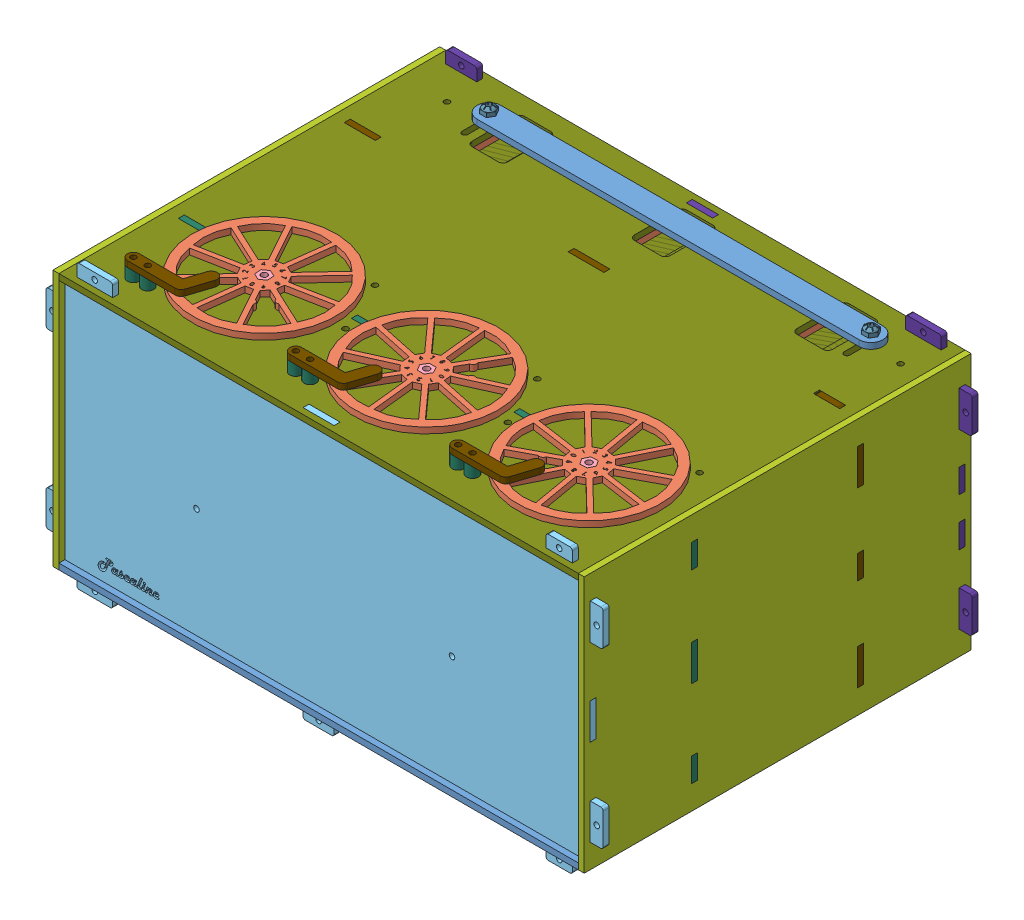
SolidWorks assembly Pascaline.SLDASM, configuration Default (file format 7000). Lengths in mm.
Overall size (316.89 316.89 215.17).
284 component instances, 43 part files, 62 mates.
Components (placement in the parent):
- BottomPanel-1: BottomPanel.SLDPRT [Default] at (-116.7085 3.175 3.175) x (1 0 0) z (0 0 -1) size (276.23 3.17 205.74)
- Input-1: Input.SLDASM [Default] at (-58.9964 162.0917 -49.9048) x (0.085321 0 0.996353) z (-0.996353 0 0.085321) size (104.09 73.64 104.09)
  - InputWheel-1: InputWheel.SLDPRT [Default] at (2.3319 -25.5667 -0.5108) x (0.5 0 -0.866025) z (0.866025 0 0.5) size (76.2 3.17 76.2)
  - AccumulatorGear-1: AccumulatorGear.SLDPRT [input2] at (2.3319 -73.8052 -0.5108) size (69.85 3.17 69.85)
  - Standoff-2in-1s4-1: Standoff-2in-1s4.SLDPRT [Default] at (2.3319 -73.1917 -0.5108) size (7.33 50.8 6.35)
  - Screw-4-40-1in-1: Screw-4-40-1in.SLDPRT [Default] at (-26.2431 -96.0302 8.7738) size (2.84 25.4 2.84)
  - Screw-4-40-1in-2: Screw-4-40-1in.SLDPRT [Default] at (-15.3284 -96.0302 23.7965) size (2.84 25.4 2.84)
  - Screw-4-40-1in-3: Screw-4-40-1in.SLDPRT [Default] at (-26.2431 -96.0302 -9.7954) size (2.84 25.4 2.84)
- Accumulator-1: Accumulator.SLDASM [Default] at (-69.3205 75.7982 -48.0636) x (0.97927 0.20256 0.00082) z (0.202557 -0.979267 0.002734) size (76.79 111.93 76.84)
  - AccumulatorGear-3: AccumulatorGear.SLDPRT [accum] at (5.3215 -39.4588 28.4724) x (0.104553 -0.002805 0.994515) z (-0.994519 0.00053 0.104555) size (69.85 3.17 69.85)
  - AccumulatorGear-4: AccumulatorGear.SLDPRT [accum] at (5.3032 -61.6837 28.4116) x (0.104553 -0.002805 0.994515) z (-0.994519 0.00053 0.104555) size (69.85 3.17 69.85)
  - Screw-4-40-1in-1: Screw-4-40-1in.SLDPRT [Default] at (-24.5385 -14.043 31.6833) x (0.998773 -0.000684 -0.049509) z (-0.049507 0.002771 -0.99877) size (2.84 25.4 2.84)
  - Screw-4-40-1in-2: Screw-4-40-1in.SLDPRT [Default] at (-20.6782 -13.9965 13.5198) x (0.998773 -0.000684 -0.049509) z (-0.049507 0.002771 -0.99877) size (2.84 25.4 2.84)
  - Screw-4-40-1in-3: Screw-4-40-1in.SLDPRT [Default] at (-16.9854 -14.0955 48.6468) x (0.998773 -0.000684 -0.049509) z (-0.049507 0.002771 -0.99877) size (2.84 25.4 2.84)
  - Screw-4-40-1in-4: Screw-4-40-1in.SLDPRT [Default] at (-24.575 -58.4928 31.5617) x (0.998773 -0.000684 -0.049509) z (-0.049507 0.002771 -0.99877) size (2.84 25.4 2.84)
  - Screw-4-40-1in-5: Screw-4-40-1in.SLDPRT [Default] at (-17.0427 -83.9452 48.4558) x (-0.902967 0.001916 -0.429705) z (0.429708 0.002116 -0.902965) size (2.84 25.4 2.84)
  - Screw-4-40-1in-6: Screw-4-40-1in.SLDPRT [Default] at (-20.7147 -58.4463 13.3983) x (0.998773 -0.000684 -0.049509) z (-0.049507 0.002771 -0.99877) size (2.84 25.4 2.84)
  - OutputGear-1: OutputGear.SLDPRT [Default] at (5.2689 -103.5935 28.297) x (0.104553 -0.002805 0.994515) z (-0.994519 0.00053 0.104555) size (50.8 3.17 50.8)
  - Standoff-4in-1s4-2: Standoff-4in-1s4.SLDPRT [Default] at (5.2689 -103.5935 28.297) x (0.104553 -0.002805 0.994515) z (-0.994519 0.00053 0.104555) size (7.33 101.6 6.35)
  - Screw-4-40-0p5in-1: Screw-4-40-0p5in.SLDPRT [Default] at (-14.6072 -113.1079 30.3598) x (1 -0.00082 -0.000001) z (-0.000001 -0.002734 0.999996) size (2.84 12.7 2.84)
  - Screw-4-40-0p5in-2: Screw-4-40-0p5in.SLDPRT [Default] at (-9.585 -113.1428 41.6391) x (1 -0.00082 -0.000001) z (-0.000001 -0.002734 0.999996) size (2.84 12.7 2.84)
  - Screw-4-40-0p5in-3: Screw-4-40-0p5in.SLDPRT [Default] at (-12.0405 -113.077 18.2826) x (1 -0.00082 -0.000001) z (-0.000001 -0.002734 0.999996) size (2.84 12.7 2.84)
  - Standoff-p75in-1s4-1: Standoff-p75in-1s4.SLDPRT [Default] at (24.329 -39.4366 14.6619) x (1 -0.00082 -0.000001) z (-0.00082 -0.999996 -0.002734) size (6.35 6.35 19.05)
  - Standoff-p75in-1s4-2: Standoff-p75in-1s4.SLDPRT [Default] at (-16.1425 -39.415 18.9167) x (0.984615 -0.00033 -0.174737) z (-0.00082 -0.999996 -0.002734) size (6.35 6.35 19.05)
  - OutputGearCap-1: OutputGearCap.SLDPRT [Default] at (5.2663 -106.7685 28.2884) x (0.104553 -0.002805 0.994515) z (-0.994519 0.00053 0.104555) size (21.59 3.17 21.59)
  - Washer-0p38in-1: Washer-0p38in.SLDPRT [Default] at (5.3522 -1.9939 28.5748) x (0.863042 0.000673 -0.505132) z (0.00082 0.999996 0.002734) size (9.65 9.65 0.76)
  - Spacer-stack-8-1: Spacer-stack-8.SLDASM [Default] at (-3.9287 -43.7527 21.5045) x (0.104553 -0.002805 0.994515) z (0.00082 0.999996 0.002734) size (13.2 11.43 25.4)
    - Spacer-hex-1s4-1: Spacer-hex-1s4.SLDPRT [Default] at (7.8847 8.4687 7.4956) size (13.2 11.43 3.17)
    - Spacer-hex-1s4-2: Spacer-hex-1s4.SLDPRT [Default] at (7.8847 8.4687 10.6706) size (13.2 11.43 3.17)
    - Spacer-hex-1s4-3: Spacer-hex-1s4.SLDPRT [Default] at (7.8847 8.4687 13.8456) size (13.2 11.43 3.17)
    - Spacer-hex-1s4-4: Spacer-hex-1s4.SLDPRT [Default] at (7.8847 8.4687 17.0206) size (13.2 11.43 3.17)
    - Spacer-hex-1s4-5: Spacer-hex-1s4.SLDPRT [Default] at (7.8847 8.4687 20.1956) size (13.2 11.43 3.17)
    - Spacer-hex-1s4-6: Spacer-hex-1s4.SLDPRT [Default] at (7.8847 8.4687 23.3706) size (13.2 11.43 3.17)
    - Spacer-hex-1s4-7: Spacer-hex-1s4.SLDPRT [Default] at (7.8847 8.4687 26.5456) size (13.2 11.43 3.17)
    - Spacer-hex-1s4-8: Spacer-hex-1s4.SLDPRT [Default] at (7.8847 8.4687 29.7206) size (13.2 11.43 3.17)
- Readout-1: Readout.SLDASM [Default] at (14.1171 39.2986 -199.7504) x (0.941933 0.3358 0) z (0 0 1) size (85.24 81.6 65.02)
  - Standoff-2p5in-1s4-3: Standoff-2p5in-1s4.SLDPRT [Default] at (-51.5451 71.035 -5.9896) x (0.829038 -0.559193 0) z (-0.559193 -0.829038 0) size (7.33 63.5 6.35)
  - ReadoutGear-1: ReadoutGear.SLDPRT [Default] at (-51.5451 71.035 43.1699) x (0.997564 -0.069756 0) z (0 0 1) size (49.17 51.37 3.17)
  - Spacer-0p25-1s4-4: Spacer-0p25-1s4.SLDPRT [Default] at (-59.1849 67.3088 36.8199) size (6.35 6.35 6.35)
  - Spacer-0p25-1s4-5: Spacer-0p25-1s4.SLDPRT [Default] at (-44.4983 66.2819 36.8199) size (6.35 6.35 6.35)
  - Spacer-0p25-1s4-6: Spacer-0p25-1s4.SLDPRT [Default] at (-50.9522 79.5143 36.8199) size (6.35 6.35 6.35)
  - ReadoutCylinder-1: ReadoutCylinder.SLDPRT [Default] at (-51.5451 71.035 33.6449) x (0.997564 -0.069756 0) z (0 0 1) size (80.12 76.2 3.17)
  - ReadoutCylinder-2: ReadoutCylinder.SLDPRT [Default] at (-51.5451 71.035 30.4699) x (0.997564 -0.069756 0) z (0 0 1) size (80.12 76.2 3.17)
  - ReadoutCylinder-3: ReadoutCylinder.SLDPRT [Default] at (-51.5451 71.035 27.2949) x (0.997564 -0.069756 0) z (0 0 1) size (80.12 76.2 3.17)
  - ReadoutCylinder-4: ReadoutCylinder.SLDPRT [Default] at (-51.5451 71.035 24.1199) x (0.997564 -0.069756 0) z (0 0 1) size (80.12 76.2 3.17)
  - ReadoutCylinder-5: ReadoutCylinder.SLDPRT [Default] at (-51.5451 71.035 20.9449) x (0.997564 -0.069756 0) z (0 0 1) size (80.12 76.2 3.17)
  - ReadoutCylinder-6: ReadoutCylinder.SLDPRT [Default] at (-51.5451 71.035 17.7699) x (0.997564 -0.069756 0) z (0 0 1) size (80.12 76.2 3.17)
  - ReadoutCylinder-7: ReadoutCylinder.SLDPRT [Default] at (-51.5451 71.035 14.5949) x (0.997564 -0.069756 0) z (0 0 1) size (80.12 76.2 3.17)
  - ReadoutCylinder-8: ReadoutCylinder.SLDPRT [Default] at (-51.5451 71.035 11.4199) x (0.997564 -0.069756 0) z (0 0 1) size (80.12 76.2 3.17)
  - Washer-0p38in-1: Washer-0p38in.SLDPRT [Default] at (-51.5451 71.035 57.5104) x (0.999237 0.039047 0) z (0 0 1) size (9.65 9.65 0.76)
  - Washer-0p38in-2: Washer-0p38in.SLDPRT [Default] at (-51.5451 71.035 -6.7516) size (9.65 9.65 0.76)
  - Spacer-hex-1s4-1: Spacer-hex-1s4.SLDPRT [Default] at (-51.5451 71.035 7.2838) x (0.829038 -0.559193 0) z (0 0 1) size (13.2 11.43 3.17)
  - Spacer-hex-1s4-2: Spacer-hex-1s4.SLDPRT [Default] at (-51.5451 71.035 4.1088) x (0.829038 -0.559193 0) z (0 0 1) size (13.2 11.43 3.17)
- Input-2: Input.SLDASM [Default] at (25.7396 162.0917 -47.1142) size (104.09 73.64 104.09)
  - InputWheel-1: InputWheel.SLDPRT [Default] at (2.3319 -25.5667 -0.5108) x (0.5 0 -0.866025) z (0.866025 0 0.5) size (76.2 3.17 76.2)
  - AccumulatorGear-1: AccumulatorGear.SLDPRT [input2] at (2.3319 -73.8052 -0.5108) size (69.85 3.17 69.85)
  - Standoff-2in-1s4-1: Standoff-2in-1s4.SLDPRT [Default] at (2.3319 -73.1917 -0.5108) size (7.33 50.8 6.35)
  - Screw-4-40-1in-1: Screw-4-40-1in.SLDPRT [Default] at (-26.2431 -96.0302 8.7738) size (2.84 25.4 2.84)
  - Screw-4-40-1in-2: Screw-4-40-1in.SLDPRT [Default] at (-15.3284 -96.0302 23.7965) size (2.84 25.4 2.84)
  - Screw-4-40-1in-3: Screw-4-40-1in.SLDPRT [Default] at (-26.2431 -96.0302 -9.7954) size (2.84 25.4 2.84)
- Accumulator-2: Accumulator.SLDASM [Default] at (5.6782 67.443 -48.0636) x (0.768779 0.639514 0.00082) z (0.63951 -0.768778 0.002734) size (76.79 111.93 76.84)
  - AccumulatorGear-3: AccumulatorGear.SLDPRT [accum] at (5.3215 -39.4588 28.4724) x (0.104553 -0.002805 0.994515) z (-0.994519 0.00053 0.104555) size (69.85 3.17 69.85)
  - AccumulatorGear-4: AccumulatorGear.SLDPRT [accum] at (5.3032 -61.6837 28.4116) x (0.104553 -0.002805 0.994515) z (-0.994519 0.00053 0.104555) size (69.85 3.17 69.85)
  - Screw-4-40-1in-1: Screw-4-40-1in.SLDPRT [Default] at (-24.5385 -14.043 31.6833) x (0.998773 -0.000684 -0.049509) z (-0.049507 0.002771 -0.99877) size (2.84 25.4 2.84)
  - Screw-4-40-1in-2: Screw-4-40-1in.SLDPRT [Default] at (-20.6782 -13.9965 13.5198) x (0.998773 -0.000684 -0.049509) z (-0.049507 0.002771 -0.99877) size (2.84 25.4 2.84)
  - Screw-4-40-1in-3: Screw-4-40-1in.SLDPRT [Default] at (-16.9854 -14.0955 48.6468) x (0.998773 -0.000684 -0.049509) z (-0.049507 0.002771 -0.99877) size (2.84 25.4 2.84)
  - Screw-4-40-1in-4: Screw-4-40-1in.SLDPRT [Default] at (-24.575 -58.4928 31.5617) x (0.998773 -0.000684 -0.049509) z (-0.049507 0.002771 -0.99877) size (2.84 25.4 2.84)
  - Screw-4-40-1in-5: Screw-4-40-1in.SLDPRT [Default] at (-17.0427 -83.9452 48.4558) x (-0.902967 0.001916 -0.429705) z (0.429708 0.002116 -0.902965) size (2.84 25.4 2.84)
  - Screw-4-40-1in-6: Screw-4-40-1in.SLDPRT [Default] at (-20.7147 -58.4463 13.3983) x (0.998773 -0.000684 -0.049509) z (-0.049507 0.002771 -0.99877) size (2.84 25.4 2.84)
  - OutputGear-1: OutputGear.SLDPRT [Default] at (5.2689 -103.5935 28.297) x (0.104553 -0.002805 0.994515) z (-0.994519 0.00053 0.104555) size (50.8 3.17 50.8)
  - Standoff-4in-1s4-2: Standoff-4in-1s4.SLDPRT [Default] at (5.2689 -103.5935 28.297) x (0.104553 -0.002805 0.994515) z (-0.994519 0.00053 0.104555) size (7.33 101.6 6.35)
  - Screw-4-40-0p5in-1: Screw-4-40-0p5in.SLDPRT [Default] at (-14.6072 -113.1079 30.3598) x (1 -0.00082 -0.000001) z (-0.000001 -0.002734 0.999996) size (2.84 12.7 2.84)
  - Screw-4-40-0p5in-2: Screw-4-40-0p5in.SLDPRT [Default] at (-9.585 -113.1428 41.6391) x (1 -0.00082 -0.000001) z (-0.000001 -0.002734 0.999996) size (2.84 12.7 2.84)
  - Screw-4-40-0p5in-3: Screw-4-40-0p5in.SLDPRT [Default] at (-12.0405 -113.077 18.2826) x (1 -0.00082 -0.000001) z (-0.000001 -0.002734 0.999996) size (2.84 12.7 2.84)
  - Standoff-p75in-1s4-1: Standoff-p75in-1s4.SLDPRT [Default] at (24.329 -39.4366 14.6619) x (1 -0.00082 -0.000001) z (-0.00082 -0.999996 -0.002734) size (6.35 6.35 19.05)
  - Standoff-p75in-1s4-2: Standoff-p75in-1s4.SLDPRT [Default] at (-16.1425 -39.415 18.9167) x (0.984615 -0.00033 -0.174737) z (-0.00082 -0.999996 -0.002734) size (6.35 6.35 19.05)
  - OutputGearCap-1: OutputGearCap.SLDPRT [Default] at (5.2663 -106.7685 28.2884) x (0.104553 -0.002805 0.994515) z (-0.994519 0.00053 0.104555) size (21.59 3.17 21.59)
  - Washer-0p38in-1: Washer-0p38in.SLDPRT [Default] at (5.3522 -1.9939 28.5748) x (0.863042 0.000673 -0.505132) z (0.00082 0.999996 0.002734) size (9.65 9.65 0.76)
  - Spacer-stack-8-1: Spacer-stack-8.SLDASM [Default] at (-3.9287 -43.7527 21.5045) x (0.104553 -0.002805 0.994515) z (0.00082 0.999996 0.002734) size (13.2 11.43 25.4)
    - Spacer-hex-1s4-1: Spacer-hex-1s4.SLDPRT [Default] at (7.8847 8.4687 7.4956) size (13.2 11.43 3.17)
    - Spacer-hex-1s4-2: Spacer-hex-1s4.SLDPRT [Default] at (7.8847 8.4687 10.6706) size (13.2 11.43 3.17)
    - Spacer-hex-1s4-3: Spacer-hex-1s4.SLDPRT [Default] at (7.8847 8.4687 13.8456) size (13.2 11.43 3.17)
    - Spacer-hex-1s4-4: Spacer-hex-1s4.SLDPRT [Default] at (7.8847 8.4687 17.0206) size (13.2 11.43 3.17)
    - Spacer-hex-1s4-5: Spacer-hex-1s4.SLDPRT [Default] at (7.8847 8.4687 20.1956) size (13.2 11.43 3.17)
    - Spacer-hex-1s4-6: Spacer-hex-1s4.SLDPRT [Default] at (7.8847 8.4687 23.3706) size (13.2 11.43 3.17)
    - Spacer-hex-1s4-7: Spacer-hex-1s4.SLDPRT [Default] at (7.8847 8.4687 26.5456) size (13.2 11.43 3.17)
    - Spacer-hex-1s4-8: Spacer-hex-1s4.SLDPRT [Default] at (7.8847 8.4687 29.7206) size (13.2 11.43 3.17)
- Readout-2: Readout.SLDASM [Default] at (59.1789 6.8317 -199.7504) x (0.964985 -0.262305 0) z (0 0 1) size (85.24 81.6 65.02)
  - Standoff-2p5in-1s4-3: Standoff-2p5in-1s4.SLDPRT [Default] at (-51.5451 71.035 -5.9896) x (0.829038 -0.559193 0) z (-0.559193 -0.829038 0) size (7.33 63.5 6.35)
  - ReadoutGear-1: ReadoutGear.SLDPRT [Default] at (-51.5451 71.035 43.1699) x (0.997564 -0.069756 0) z (0 0 1) size (49.17 51.37 3.17)
  - Spacer-0p25-1s4-4: Spacer-0p25-1s4.SLDPRT [Default] at (-59.1849 67.3088 36.8199) size (6.35 6.35 6.35)
  - Spacer-0p25-1s4-5: Spacer-0p25-1s4.SLDPRT [Default] at (-44.4983 66.2819 36.8199) size (6.35 6.35 6.35)
  - Spacer-0p25-1s4-6: Spacer-0p25-1s4.SLDPRT [Default] at (-50.9522 79.5143 36.8199) size (6.35 6.35 6.35)
  - ReadoutCylinder-1: ReadoutCylinder.SLDPRT [Default] at (-51.5451 71.035 33.6449) x (0.997564 -0.069756 0) z (0 0 1) size (80.12 76.2 3.17)
  - ReadoutCylinder-2: ReadoutCylinder.SLDPRT [Default] at (-51.5451 71.035 30.4699) x (0.997564 -0.069756 0) z (0 0 1) size (80.12 76.2 3.17)
  - ReadoutCylinder-3: ReadoutCylinder.SLDPRT [Default] at (-51.5451 71.035 27.2949) x (0.997564 -0.069756 0) z (0 0 1) size (80.12 76.2 3.17)
  - ReadoutCylinder-4: ReadoutCylinder.SLDPRT [Default] at (-51.5451 71.035 24.1199) x (0.997564 -0.069756 0) z (0 0 1) size (80.12 76.2 3.17)
  - ReadoutCylinder-5: ReadoutCylinder.SLDPRT [Default] at (-51.5451 71.035 20.9449) x (0.997564 -0.069756 0) z (0 0 1) size (80.12 76.2 3.17)
  - ReadoutCylinder-6: ReadoutCylinder.SLDPRT [Default] at (-51.5451 71.035 17.7699) x (0.997564 -0.069756 0) z (0 0 1) size (80.12 76.2 3.17)
  - ReadoutCylinder-7: ReadoutCylinder.SLDPRT [Default] at (-51.5451 71.035 14.5949) x (0.997564 -0.069756 0) z (0 0 1) size (80.12 76.2 3.17)
  - ReadoutCylinder-8: ReadoutCylinder.SLDPRT [Default] at (-51.5451 71.035 11.4199) x (0.997564 -0.069756 0) z (0 0 1) size (80.12 76.2 3.17)
  - Washer-0p38in-1: Washer-0p38in.SLDPRT [Default] at (-51.5451 71.035 57.5104) x (0.999237 0.039047 0) z (0 0 1) size (9.65 9.65 0.76)
  - Washer-0p38in-2: Washer-0p38in.SLDPRT [Default] at (-51.5451 71.035 -6.7516) size (9.65 9.65 0.76)
  - Spacer-hex-1s4-1: Spacer-hex-1s4.SLDPRT [Default] at (-51.5451 71.035 7.2838) x (0.829038 -0.559193 0) z (0 0 1) size (13.2 11.43 3.17)
  - Spacer-hex-1s4-2: Spacer-hex-1s4.SLDPRT [Default] at (-51.5451 71.035 4.1088) x (0.829038 -0.559193 0) z (0 0 1) size (13.2 11.43 3.17)
- Input-3: Input.SLDASM [Default] at (116.724 162.0917 -48.2907) x (-0.997759 0 0.066903) z (-0.066903 0 -0.997759) size (104.09 73.64 104.09)
  - InputWheel-1: InputWheel.SLDPRT [Default] at (2.3319 -25.5667 -0.5108) x (0.5 0 -0.866025) z (0.866025 0 0.5) size (76.2 3.17 76.2)
  - AccumulatorGear-1: AccumulatorGear.SLDPRT [input2] at (2.3319 -73.8052 -0.5108) size (69.85 3.17 69.85)
  - Standoff-2in-1s4-1: Standoff-2in-1s4.SLDPRT [Default] at (2.3319 -73.1917 -0.5108) size (7.33 50.8 6.35)
  - Screw-4-40-1in-1: Screw-4-40-1in.SLDPRT [Default] at (-26.2431 -96.0302 8.7738) size (2.84 25.4 2.84)
  - Screw-4-40-1in-2: Screw-4-40-1in.SLDPRT [Default] at (-15.3284 -96.0302 23.7965) size (2.84 25.4 2.84)
  - Screw-4-40-1in-3: Screw-4-40-1in.SLDPRT [Default] at (-26.2431 -96.0302 -9.7954) size (2.84 25.4 2.84)
- Accumulator-4: Accumulator.SLDASM [Default] at (141.6672 59.0787 -48.0636) x (0.171779 -0.985135 0.00082) z (-0.985132 -0.171776 0.002734) size (76.79 111.93 76.84)
  - AccumulatorGear-3: AccumulatorGear.SLDPRT [accum] at (5.3215 -39.4588 28.4724) x (0.104553 -0.002805 0.994515) z (-0.994519 0.00053 0.104555) size (69.85 3.17 69.85)
  - AccumulatorGear-4: AccumulatorGear.SLDPRT [accum] at (5.3032 -61.6837 28.4116) x (0.104553 -0.002805 0.994515) z (-0.994519 0.00053 0.104555) size (69.85 3.17 69.85)
  - Screw-4-40-1in-1: Screw-4-40-1in.SLDPRT [Default] at (-24.5385 -14.043 31.6833) x (0.998773 -0.000684 -0.049509) z (-0.049507 0.002771 -0.99877) size (2.84 25.4 2.84)
  - Screw-4-40-1in-2: Screw-4-40-1in.SLDPRT [Default] at (-20.6782 -13.9965 13.5198) x (0.998773 -0.000684 -0.049509) z (-0.049507 0.002771 -0.99877) size (2.84 25.4 2.84)
  - Screw-4-40-1in-3: Screw-4-40-1in.SLDPRT [Default] at (-16.9854 -14.0955 48.6468) x (0.998773 -0.000684 -0.049509) z (-0.049507 0.002771 -0.99877) size (2.84 25.4 2.84)
  - Screw-4-40-1in-4: Screw-4-40-1in.SLDPRT [Default] at (-24.575 -58.4928 31.5617) x (0.998773 -0.000684 -0.049509) z (-0.049507 0.002771 -0.99877) size (2.84 25.4 2.84)
  - Screw-4-40-1in-5: Screw-4-40-1in.SLDPRT [Default] at (-17.0427 -83.9452 48.4558) x (-0.902967 0.001916 -0.429705) z (0.429708 0.002116 -0.902965) size (2.84 25.4 2.84)
  - Screw-4-40-1in-6: Screw-4-40-1in.SLDPRT [Default] at (-20.7147 -58.4463 13.3983) x (0.998773 -0.000684 -0.049509) z (-0.049507 0.002771 -0.99877) size (2.84 25.4 2.84)
  - OutputGear-1: OutputGear.SLDPRT [Default] at (5.2689 -103.5935 28.297) x (0.104553 -0.002805 0.994515) z (-0.994519 0.00053 0.104555) size (50.8 3.17 50.8)
  - Standoff-4in-1s4-2: Standoff-4in-1s4.SLDPRT [Default] at (5.2689 -103.5935 28.297) x (0.104553 -0.002805 0.994515) z (-0.994519 0.00053 0.104555) size (7.33 101.6 6.35)
  - Screw-4-40-0p5in-1: Screw-4-40-0p5in.SLDPRT [Default] at (-14.6072 -113.1079 30.3598) x (1 -0.00082 -0.000001) z (-0.000001 -0.002734 0.999996) size (2.84 12.7 2.84)
  - Screw-4-40-0p5in-2: Screw-4-40-0p5in.SLDPRT [Default] at (-9.585 -113.1428 41.6391) x (1 -0.00082 -0.000001) z (-0.000001 -0.002734 0.999996) size (2.84 12.7 2.84)
  - Screw-4-40-0p5in-3: Screw-4-40-0p5in.SLDPRT [Default] at (-12.0405 -113.077 18.2826) x (1 -0.00082 -0.000001) z (-0.000001 -0.002734 0.999996) size (2.84 12.7 2.84)
  - Standoff-p75in-1s4-1: Standoff-p75in-1s4.SLDPRT [Default] at (24.329 -39.4366 14.6619) x (1 -0.00082 -0.000001) z (-0.00082 -0.999996 -0.002734) size (6.35 6.35 19.05)
  - Standoff-p75in-1s4-2: Standoff-p75in-1s4.SLDPRT [Default] at (-16.1425 -39.415 18.9167) x (0.984615 -0.00033 -0.174737) z (-0.00082 -0.999996 -0.002734) size (6.35 6.35 19.05)
  - OutputGearCap-1: OutputGearCap.SLDPRT [Default] at (5.2663 -106.7685 28.2884) x (0.104553 -0.002805 0.994515) z (-0.994519 0.00053 0.104555) size (21.59 3.17 21.59)
  - Washer-0p38in-1: Washer-0p38in.SLDPRT [Default] at (5.3522 -1.9939 28.5748) x (0.863042 0.000673 -0.505132) z (0.00082 0.999996 0.002734) size (9.65 9.65 0.76)
  - Spacer-stack-8-1: Spacer-stack-8.SLDASM [Default] at (-3.9287 -43.7527 21.5045) x (0.104553 -0.002805 0.994515) z (0.00082 0.999996 0.002734) size (13.2 11.43 25.4)
    - Spacer-hex-1s4-1: Spacer-hex-1s4.SLDPRT [Default] at (7.8847 8.4687 7.4956) size (13.2 11.43 3.17)
    - Spacer-hex-1s4-2: Spacer-hex-1s4.SLDPRT [Default] at (7.8847 8.4687 10.6706) size (13.2 11.43 3.17)
    - Spacer-hex-1s4-3: Spacer-hex-1s4.SLDPRT [Default] at (7.8847 8.4687 13.8456) size (13.2 11.43 3.17)
    - Spacer-hex-1s4-4: Spacer-hex-1s4.SLDPRT [Default] at (7.8847 8.4687 17.0206) size (13.2 11.43 3.17)
    - Spacer-hex-1s4-5: Spacer-hex-1s4.SLDPRT [Default] at (7.8847 8.4687 20.1956) size (13.2 11.43 3.17)
    - Spacer-hex-1s4-6: Spacer-hex-1s4.SLDPRT [Default] at (7.8847 8.4687 23.3706) size (13.2 11.43 3.17)
    - Spacer-hex-1s4-7: Spacer-hex-1s4.SLDPRT [Default] at (7.8847 8.4687 26.5456) size (13.2 11.43 3.17)
    - Spacer-hex-1s4-8: Spacer-hex-1s4.SLDPRT [Default] at (7.8847 8.4687 29.7206) size (13.2 11.43 3.17)
- Readout-3: Readout.SLDASM [Default] at (148.6851 8.0943 -199.7504) x (0.974395 -0.224842 0) z (0 0 1) size (85.24 81.6 65.02)
  - Standoff-2p5in-1s4-3: Standoff-2p5in-1s4.SLDPRT [Default] at (-51.5451 71.035 -5.9896) x (0.829038 -0.559193 0) z (-0.559193 -0.829038 0) size (7.33 63.5 6.35)
  - ReadoutGear-1: ReadoutGear.SLDPRT [Default] at (-51.5451 71.035 43.1699) x (0.997564 -0.069756 0) z (0 0 1) size (49.17 51.37 3.17)
  - Spacer-0p25-1s4-4: Spacer-0p25-1s4.SLDPRT [Default] at (-59.1849 67.3088 36.8199) size (6.35 6.35 6.35)
  - Spacer-0p25-1s4-5: Spacer-0p25-1s4.SLDPRT [Default] at (-44.4983 66.2819 36.8199) size (6.35 6.35 6.35)
  - Spacer-0p25-1s4-6: Spacer-0p25-1s4.SLDPRT [Default] at (-50.9522 79.5143 36.8199) size (6.35 6.35 6.35)
  - ReadoutCylinder-1: ReadoutCylinder.SLDPRT [Default] at (-51.5451 71.035 33.6449) x (0.997564 -0.069756 0) z (0 0 1) size (80.12 76.2 3.17)
  - ReadoutCylinder-2: ReadoutCylinder.SLDPRT [Default] at (-51.5451 71.035 30.4699) x (0.997564 -0.069756 0) z (0 0 1) size (80.12 76.2 3.17)
  - ReadoutCylinder-3: ReadoutCylinder.SLDPRT [Default] at (-51.5451 71.035 27.2949) x (0.997564 -0.069756 0) z (0 0 1) size (80.12 76.2 3.17)
  - ReadoutCylinder-4: ReadoutCylinder.SLDPRT [Default] at (-51.5451 71.035 24.1199) x (0.997564 -0.069756 0) z (0 0 1) size (80.12 76.2 3.17)
  - ReadoutCylinder-5: ReadoutCylinder.SLDPRT [Default] at (-51.5451 71.035 20.9449) x (0.997564 -0.069756 0) z (0 0 1) size (80.12 76.2 3.17)
  - ReadoutCylinder-6: ReadoutCylinder.SLDPRT [Default] at (-51.5451 71.035 17.7699) x (0.997564 -0.069756 0) z (0 0 1) size (80.12 76.2 3.17)
  - ReadoutCylinder-7: ReadoutCylinder.SLDPRT [Default] at (-51.5451 71.035 14.5949) x (0.997564 -0.069756 0) z (0 0 1) size (80.12 76.2 3.17)
  - ReadoutCylinder-8: ReadoutCylinder.SLDPRT [Default] at (-51.5451 71.035 11.4199) x (0.997564 -0.069756 0) z (0 0 1) size (80.12 76.2 3.17)
  - Washer-0p38in-1: Washer-0p38in.SLDPRT [Default] at (-51.5451 71.035 57.5104) x (0.999237 0.039047 0) z (0 0 1) size (9.65 9.65 0.76)
  - Washer-0p38in-2: Washer-0p38in.SLDPRT [Default] at (-51.5451 71.035 -6.7516) size (9.65 9.65 0.76)
  - Spacer-hex-1s4-1: Spacer-hex-1s4.SLDPRT [Default] at (-51.5451 71.035 7.2838) x (0.829038 -0.559193 0) z (0 0 1) size (13.2 11.43 3.17)
  - Spacer-hex-1s4-2: Spacer-hex-1s4.SLDPRT [Default] at (-51.5451 71.035 4.1088) x (0.829038 -0.559193 0) z (0 0 1) size (13.2 11.43 3.17)
- BackPanel-1: BackPanel.SLDPRT [Default] at (-116.7085 3.175 -199.39) size (296.29 150.24 3.18)
- Ratchets-1: Ratchets.SLDASM [Default] at (-81.708 -156.4494 -388.6538) x (0.938568 0.345094 0) z (0 0 1) size (314.7 232.09 30.1)
  - MidPanel2-1: MidPanel2.SLDPRT [Default] at (22.2351 161.8968 243.2388) x (0.938568 -0.345094 0) z (0 0 1) size (282.58 143.38 3.18)
  - Standoff-0p75in-1s4-2: Standoff-0p75in-1s4.SLDPRT [Default] at (71.4078 258.8325 265.4638) x (-0.999902 -0.013974 0) z (0.013974 -0.999902 0) size (7.33 19.05 6.35)
  - Washer-0p38in-4: Washer-0p38in.SLDPRT [Default] at (71.4078 258.8325 265.4638) x (0.886945 0.461875 0) z (0 0 1) size (9.65 9.65 0.76)
  - Spacer-0p25-1s4-1: Spacer-0p25-1s4.SLDPRT [Default] at (71.4078 258.8325 266.2258) x (0.918268 0.39596 0) z (0 0 1) size (6.35 6.35 6.35)
  - Washer-0p38in-1: Washer-0p38in.SLDPRT [Default] at (71.4078 258.8325 272.5758) x (0.974797 -0.223092 0) z (0 0 1) size (9.65 9.65 0.76)
  - Standoff-0p75in-1s4-1: Standoff-0p75in-1s4.SLDPRT [Default] at (152.4626 229.0302 265.4638) x (-0.830154 -0.557534 0) z (0.557534 -0.830154 0) size (7.33 19.05 6.35)
  - Washer-0p38in-5: Washer-0p38in.SLDPRT [Default] at (152.4626 229.0302 265.4638) x (0.971362 -0.237603 0) z (0 0 1) size (9.65 9.65 0.76)
  - Spacer-0p25-1s4-2: Spacer-0p25-1s4.SLDPRT [Default] at (152.4626 229.0302 266.2258) x (0.998153 0.060744 0) z (0 0 1) size (6.35 6.35 6.35)
  - Washer-0p38in-2: Washer-0p38in.SLDPRT [Default] at (152.4626 229.0302 272.5758) x (0.964442 -0.264293 0) z (0 0 1) size (9.65 9.65 0.76)
  - Standoff-0p75in-1s4-3: Standoff-0p75in-1s4.SLDPRT [Default] at (233.5173 199.2278 265.4638) x (0.732123 -0.681172 0) z (0.681172 0.732123 0) size (7.33 19.05 6.35)
  - Washer-0p38in-6: Washer-0p38in.SLDPRT [Default] at (233.5173 199.2278 265.4638) x (0.998962 0.045555 0) z (0 0 1) size (9.65 9.65 0.76)
  - Spacer-0p25-1s4-3: Spacer-0p25-1s4.SLDPRT [Default] at (233.5173 199.2278 266.2258) x (-0.1226 0.992456 0) z (0 0 1) size (6.35 6.35 6.35)
  - Washer-0p38in-3: Washer-0p38in.SLDPRT [Default] at (233.5173 199.2278 272.5758) x (0.76285 -0.646575 0) z (0 0 1) size (9.65 9.65 0.76)
  - SautoirBacking-2: SautoirBacking.SLDPRT [Default] at (77.1723 171.4661 252.7638) x (0.938568 -0.345094 0) z (0 0 1) size (30.48 35.56 3.17)
  - Spacer-0p25-1s4-4: Spacer-0p25-1s4.SLDPRT [Default] at (97.8841 198.3555 246.4138) size (6.35 6.35 6.35)
  - Spacer-0p25-1s4-5: Spacer-0p25-1s4.SLDPRT [Default] at (87.8039 170.9399 246.4138) size (6.35 6.35 6.35)
  - SautoirBacking-3: SautoirBacking.SLDPRT [Default] at (158.2271 141.6638 252.7638) x (0.938568 -0.345094 0) z (0 0 1) size (30.48 35.56 3.17)
  - Spacer-0p25-1s4-6: Spacer-0p25-1s4.SLDPRT [Default] at (168.8586 141.1376 246.4138) size (6.35 6.35 6.35)
  - Spacer-0p25-1s4-7: Spacer-0p25-1s4.SLDPRT [Default] at (178.9388 168.5531 246.4138) x (-0.849972 -0.526827 0) z (0 0 1) size (6.35 6.35 6.35)
- Backstop-1: Backstop.SLDASM [Default] at (-134.4479 68.9887 -194.8362) x (0.911442 -0.411429 0) z (0 0 1) size (69.7 32.28 14.68)
  - BackstopPawl-1: BackstopPawl.SLDPRT [Default] at (4.0576 45.8485 75.5832) size (69.7 32.28 3.18)
  - BackstopPawl-2: BackstopPawl.SLDPRT [Default] at (4.0576 45.8485 72.4082) size (69.7 32.28 3.18)
  - Nut-3s8-1: Nut-3s8.SLDPRT [Default] at (57.7688 59.5119 70.4238) x (0 0 1) z (0 -1 0) size (8.33 14.29 16.5)
  - BackstopCap-1: BackstopCap.SLDPRT [Default] at (57.7688 59.5119 67.2488) x (0.989802 0.142448 0) z (0 0 1) size (15.88 15.88 3.17)
  - BackstopCap-2: BackstopCap.SLDPRT [Default] at (57.7688 59.5119 78.7582) x (0.999963 -0.008552 0) z (0 0 1) size (15.88 15.88 3.17)
- Backstop-2: Backstop.SLDASM [Default] at (-49.066 69.7128 -194.8362) x (0.901561 -0.432653 0) z (0 0 1) size (69.7 32.28 14.68)
  - BackstopPawl-1: BackstopPawl.SLDPRT [Default] at (4.0576 45.8485 75.5832) size (69.7 32.28 3.18)
  - BackstopPawl-2: BackstopPawl.SLDPRT [Default] at (4.0576 45.8485 72.4082) size (69.7 32.28 3.18)
  - Nut-3s8-1: Nut-3s8.SLDPRT [Default] at (57.7688 59.5119 70.4238) x (0 0 1) z (0 -1 0) size (8.33 14.29 16.5)
  - BackstopCap-1: BackstopCap.SLDPRT [Default] at (57.7688 59.5119 67.2488) x (0.989802 0.142448 0) z (0 0 1) size (15.88 15.88 3.17)
  - BackstopCap-2: BackstopCap.SLDPRT [Default] at (57.7688 59.5119 78.7582) x (0.999963 -0.008552 0) z (0 0 1) size (15.88 15.88 3.17)
- Backstop-3: Backstop.SLDASM [Default] at (38.2293 69.0196 -194.8362) x (0.911023 -0.412356 0) z (0 0 1) size (69.7 32.28 14.68)
  - BackstopPawl-1: BackstopPawl.SLDPRT [Default] at (4.0576 45.8485 75.5832) size (69.7 32.28 3.18)
  - BackstopPawl-2: BackstopPawl.SLDPRT [Default] at (4.0576 45.8485 72.4082) size (69.7 32.28 3.18)
  - Nut-3s8-1: Nut-3s8.SLDPRT [Default] at (57.7688 59.5119 70.4238) x (0 0 1) z (0 -1 0) size (8.33 14.29 16.5)
  - BackstopCap-1: BackstopCap.SLDPRT [Default] at (57.7688 59.5119 67.2488) x (0.989802 0.142448 0) z (0 0 1) size (15.88 15.88 3.17)
  - BackstopCap-2: BackstopCap.SLDPRT [Default] at (57.7688 59.5119 78.7582) x (0.999963 -0.008552 0) z (0 0 1) size (15.88 15.88 3.17)
- Sautoir-1: Sautoir.SLDASM [Default] at (-1.8737 11.0276 -154.4839) x (0 0 1) z (-0.978763 0.204997 0) size (57.15 100.16 88.9)
  - SautoirMount-1: SautoirMount.SLDPRT [SautoirMountA] at (12.2439 19.1483 75.6794) size (3.17 12.7 68.58)
  - SautoirMount-2: SautoirMount.SLDPRT [SautoirMountB] at (15.4189 19.1483 75.6794) size (3.17 12.7 68.58)
  - SautoirMountC2-3: SautoirMountC2.SLDPRT [Default] at (18.5939 19.1483 29.3244) x (0 0 1) z (-1 0 0) size (19.05 12.7 3.17)
  - SautoirMountC2-2: SautoirMountC2.SLDPRT [Default] at (21.7689 19.1483 29.3244) x (0 0 1) z (-1 0 0) size (19.05 12.7 3.17)
  - Standoff-1p75in-1s4-1: Standoff-1p75in-1s4.SLDPRT [Default] at (59.8689 25.4983 19.7994) x (0 0.866025 0.5) z (0 -0.5 0.866025) size (7.33 44.45 6.35)
  - SautoirArm-1: SautoirArm.SLDPRT [Default] at (24.9439 6.4483 26.1494) x (0 0 -1) z (1 0 0) size (12.7 38.1 3.17)
  - SautoirArm-2: SautoirArm.SLDPRT [Default] at (34.4689 6.4483 26.1494) x (0 0 -1) z (1 0 0) size (12.7 38.1 3.17)
  - CarryPawl-4: CarryPawl.SLDPRT [Default] at (28.1189 -18.4346 33.7088) x (0 0.213886 -0.976859) z (1 0 0) size (55.75 22.21 3.05)
  - CarryPawl-3: CarryPawl.SLDPRT [Default] at (31.1669 -18.4346 33.7088) x (0 0.213886 -0.976859) z (1 0 0) size (55.75 22.21 3.05)
  - CarryLever-2: CarryLever.SLDPRT [CarryLeverB] at (56.6939 19.7833 26.1494) x (0 0 -1) z (1 0 0) size (39.37 87.39 3.17)
  - CarryLever-3: CarryLever.SLDPRT [CarryLeverA] at (59.8689 19.7833 26.1494) x (0 0 -1) z (1 0 0) size (39.37 87.39 3.17)
  - SautoirMountC-3: SautoirMountC.SLDPRT [Default] at (53.5189 31.8483 9.4956) x (0 0 -1) z (-1 0 0) size (17.14 12.7 3.17)
  - Spacer-0p25-1s4-1: Spacer-0p25-1s4.SLDPRT [Default] at (28.1189 38.1983 19.7994) x (0 0 -1) z (1 0 0) size (6.35 6.35 6.35)
  - Bolt-3s8-0p625-1: Bolt-3s8-0p625.SLDPRT [Default] at (63.0439 70.5305 5.3227) x (1 0 0) z (0 -0.672316 0.740264) size (22.23 14.29 16.5)
  - Nut-3s8-1: Nut-3s8.SLDPRT [Default] at (48.3595 70.5305 5.3227) x (1 0 0) z (0 -0.672316 0.740264) size (8.33 14.29 16.5)
  - Locknut-1: Locknut.SLDPRT [Default] at (39.7648 12.7983 19.7994) x (0 0 1) z (-1 0 0) size (7.33 6.35 3.56)
- Sautoir-2: Sautoir.SLDASM [Default] at (85.88 13.1914 -154.4839) x (0 0 1) z (-0.985824 0.167782 0) size (57.15 100.16 88.9)
  - SautoirMount-1: SautoirMount.SLDPRT [SautoirMountA] at (12.2439 19.1483 75.6794) size (3.17 12.7 68.58)
  - SautoirMount-2: SautoirMount.SLDPRT [SautoirMountB] at (15.4189 19.1483 75.6794) size (3.17 12.7 68.58)
  - SautoirMountC2-3: SautoirMountC2.SLDPRT [Default] at (18.5939 19.1483 29.3244) x (0 0 1) z (-1 0 0) size (19.05 12.7 3.17)
  - SautoirMountC2-2: SautoirMountC2.SLDPRT [Default] at (21.7689 19.1483 29.3244) x (0 0 1) z (-1 0 0) size (19.05 12.7 3.17)
  - Standoff-1p75in-1s4-1: Standoff-1p75in-1s4.SLDPRT [Default] at (59.8689 25.4983 19.7994) x (0 0.866025 0.5) z (0 -0.5 0.866025) size (7.33 44.45 6.35)
  - SautoirArm-1: SautoirArm.SLDPRT [Default] at (24.9439 6.4483 26.1494) x (0 0 -1) z (1 0 0) size (12.7 38.1 3.17)
  - SautoirArm-2: SautoirArm.SLDPRT [Default] at (34.4689 6.4483 26.1494) x (0 0 -1) z (1 0 0) size (12.7 38.1 3.17)
  - CarryPawl-4: CarryPawl.SLDPRT [Default] at (28.1189 -18.4346 33.7088) x (0 0.213886 -0.976859) z (1 0 0) size (55.75 22.21 3.05)
  - CarryPawl-3: CarryPawl.SLDPRT [Default] at (31.1669 -18.4346 33.7088) x (0 0.213886 -0.976859) z (1 0 0) size (55.75 22.21 3.05)
  - CarryLever-2: CarryLever.SLDPRT [CarryLeverB] at (56.6939 19.7833 26.1494) x (0 0 -1) z (1 0 0) size (39.37 87.39 3.17)
  - CarryLever-3: CarryLever.SLDPRT [CarryLeverA] at (59.8689 19.7833 26.1494) x (0 0 -1) z (1 0 0) size (39.37 87.39 3.17)
  - SautoirMountC-3: SautoirMountC.SLDPRT [Default] at (53.5189 31.8483 9.4956) x (0 0 -1) z (-1 0 0) size (17.14 12.7 3.17)
  - Spacer-0p25-1s4-1: Spacer-0p25-1s4.SLDPRT [Default] at (28.1189 38.1983 19.7994) x (0 0 -1) z (1 0 0) size (6.35 6.35 6.35)
  - Bolt-3s8-0p625-1: Bolt-3s8-0p625.SLDPRT [Default] at (63.0439 70.5305 5.3227) x (1 0 0) z (0 -0.672316 0.740264) size (22.23 14.29 16.5)
  - Nut-3s8-1: Nut-3s8.SLDPRT [Default] at (48.3595 70.5305 5.3227) x (1 0 0) z (0 -0.672316 0.740264) size (8.33 14.29 16.5)
  - Locknut-1: Locknut.SLDPRT [Default] at (39.7648 12.7983 19.7994) x (0 0 1) z (-1 0 0) size (7.33 6.35 3.56)
- MidPanel1-1: MidPanel1.SLDPRT [Default] at (-116.7085 3.175 -57.15) size (282.58 143.38 3.18)
- TopAssembly-2: TopAssembly.SLDASM [Default] at (-100.0552 -8.4514 -297.0961) size (276.23 41.27 205.74)
  - TopPanel-1: TopPanel.SLDPRT [Default] at (-16.6534 141.8014 300.2711) size (276.23 3.17 205.74)
  - InputBacking-1: InputBacking.SLDPRT [Default] at (41.7666 138.6264 249.4711) size (81.07 3.17 76.2)
  - Spacer-0p25-1s4-1: Spacer-0p25-1s4.SLDPRT [Default] at (12.7674 151.3264 282.4432) x (0.646996 0 -0.762494) z (0 -1 0) size (6.35 6.35 6.35)
  - Spacer-0p25-1s4-2: Spacer-0p25-1s4.SLDPRT [Default] at (5.1474 151.3264 282.4432) x (0.139598 0 -0.990208) z (0 -1 0) size (6.35 6.35 6.35)
  - FingerStop-1: FingerStop.SLDPRT [Default] at (5.1474 151.3264 282.4432) size (35.67 3.17 18.43)
  - InputBacking-2: InputBacking.SLDPRT [Default] at (128.1266 138.6264 249.4711) size (81.07 3.17 76.2)
  - Spacer-0p25-1s4-3: Spacer-0p25-1s4.SLDPRT [Default] at (91.5074 151.3264 282.4432) x (0.999262 0 0.038412) z (0 -1 0) size (6.35 6.35 6.35)
  - Spacer-0p25-1s4-4: Spacer-0p25-1s4.SLDPRT [Default] at (99.1274 151.3264 282.4432) x (0.62391 0 0.781496) z (0 -1 0) size (6.35 6.35 6.35)
  - FingerStop-3: FingerStop.SLDPRT [Default] at (91.5074 151.3264 282.4432) size (35.67 3.17 18.43)
  - InputBacking-3: InputBacking.SLDPRT [Default] at (214.4866 138.6264 249.4711) size (81.07 3.17 76.2)
  - Spacer-0p25-1s4-5: Spacer-0p25-1s4.SLDPRT [Default] at (185.4874 151.3264 282.4432) x (0.993795 0 0.111224) z (0 -1 0) size (6.35 6.35 6.35)
  - Spacer-0p25-1s4-6: Spacer-0p25-1s4.SLDPRT [Default] at (177.8674 151.3264 282.4432) x (0.413398 0 0.91055) z (0 -1 0) size (6.35 6.35 6.35)
  - FingerStop-4: FingerStop.SLDPRT [Default] at (177.8674 151.3264 282.4432) size (35.67 3.17 18.43)
  - ReadoutCover-1: ReadoutCover.SLDPRT [Default] at (26.5774 144.9764 114.7787) size (215.9 3.17 12.7)
  - Locknut-1: Locknut.SLDPRT [Default] at (26.5774 150.2723 114.7787) x (1 0 0) z (0 -1 0) size (7.33 6.35 3.56)
  - Locknut-2: Locknut.SLDPRT [Default] at (229.7774 150.2723 114.7787) x (1 0 0) z (0 -1 0) size (7.33 6.35 3.56)
  - ReadoutShield-1: ReadoutShield.SLDPRT [Default] at (1.1266 138.6264 133.2661) size (254 3.17 30.48)
  - InputBrace-1: InputBrace.SLDPRT [Default] at (36.0516 113.2264 249.4711) size (196.85 3.17 12.7)
  - Standoff-1in-1s4-1: Standoff-1in-1s4.SLDPRT [Default] at (171.3066 141.8014 249.4711) x (1 0 0) z (0 -1 0) size (6.35 6.35 25.4)
  - Standoff-1in-1s4-2: Standoff-1in-1s4.SLDPRT [Default] at (84.9466 141.8014 249.4711) x (-0.986882 0 0.161445) z (0 -1 0) size (6.35 6.35 25.4)
- FrontAssembly-1: FrontAssembly.SLDASM [Default] at (-117.4883 -71.9112 -225.649) size (296.29 150.24 6.35)
  - FrontPanel-1: FrontPanel.SLDPRT [Default] at (0.7798 75.0862 222.474) size (296.29 150.24 3.18)
  - FrontColorPlate-1: FrontColorPlate.SLDPRT [Default] at (65.7137 104.9312 219.299) size (146.05 57.15 3.17)
- SidePanel-1: SidePanel.SLDPRT [Default] at (-116.7085 0 -202.565) x (-1 0 0) z (0 0 -1) size (3.17 136.53 205.74)
- SidePanel-2: SidePanel.SLDPRT [Default] at (162.6915 0 -202.565) x (-1 0 0) z (0 0 -1) size (3.17 136.53 205.74)
- Spacer-stack-7-1: Spacer-stack-7.SLDASM [Default] at (-47.8245 43.9561 -139.3856) x (-0.303835 0.952725 0) z (0 0 1) size (13.2 11.43 22.23)
  - Spacer-hex-1s4-1: Spacer-hex-1s4.SLDPRT [Default] at (7.8847 8.4687 7.4956) size (13.2 11.43 3.17)
  - Spacer-hex-1s4-2: Spacer-hex-1s4.SLDPRT [Default] at (7.8847 8.4687 10.6706) size (13.2 11.43 3.17)
  - Spacer-hex-1s4-3: Spacer-hex-1s4.SLDPRT [Default] at (7.8847 8.4687 13.8456) size (13.2 11.43 3.17)
  - Spacer-hex-1s4-4: Spacer-hex-1s4.SLDPRT [Default] at (7.8847 8.4687 17.0206) size (13.2 11.43 3.17)
  - Spacer-hex-1s4-5: Spacer-hex-1s4.SLDPRT [Default] at (7.8847 8.4687 20.1956) size (13.2 11.43 3.17)
  - Spacer-hex-1s4-6: Spacer-hex-1s4.SLDPRT [Default] at (7.8847 8.4687 23.3706) size (13.2 11.43 3.17)
  - Spacer-hex-1s4-7: Spacer-hex-1s4.SLDPRT [Default] at (7.8847 8.4687 26.5456) size (13.2 11.43 3.17)
- Spacer-stack-7-2: Spacer-stack-7.SLDASM [Default] at (34.3399 39.169 -139.3856) x (0.246035 0.969261 0) z (0 0 1) size (13.2 11.43 22.23)
  - Spacer-hex-1s4-1: Spacer-hex-1s4.SLDPRT [Default] at (7.8847 8.4687 7.4956) size (13.2 11.43 3.17)
  - Spacer-hex-1s4-2: Spacer-hex-1s4.SLDPRT [Default] at (7.8847 8.4687 10.6706) size (13.2 11.43 3.17)
  - Spacer-hex-1s4-3: Spacer-hex-1s4.SLDPRT [Default] at (7.8847 8.4687 13.8456) size (13.2 11.43 3.17)
  - Spacer-hex-1s4-4: Spacer-hex-1s4.SLDPRT [Default] at (7.8847 8.4687 17.0206) size (13.2 11.43 3.17)
  - Spacer-hex-1s4-5: Spacer-hex-1s4.SLDPRT [Default] at (7.8847 8.4687 20.1956) size (13.2 11.43 3.17)
  - Spacer-hex-1s4-6: Spacer-hex-1s4.SLDPRT [Default] at (7.8847 8.4687 23.3706) size (13.2 11.43 3.17)
  - Spacer-hex-1s4-7: Spacer-hex-1s4.SLDPRT [Default] at (7.8847 8.4687 26.5456) size (13.2 11.43 3.17)
- Spacer-stack-10-2: Spacer-stack-10.SLDASM [Default] at (119.6958 59.1991 -148.9106) x (-0.961776 -0.273837 0) z (0 0 1) size (13.2 11.43 31.75)
  - Spacer-hex-1s4-1: Spacer-hex-1s4.SLDPRT [Default] at (7.8847 8.4687 7.4956) size (13.2 11.43 3.17)
  - Spacer-hex-1s4-2: Spacer-hex-1s4.SLDPRT [Default] at (7.8847 8.4687 10.6706) size (13.2 11.43 3.17)
  - Spacer-hex-1s4-3: Spacer-hex-1s4.SLDPRT [Default] at (7.8847 8.4687 13.8456) size (13.2 11.43 3.17)
  - Spacer-hex-1s4-4: Spacer-hex-1s4.SLDPRT [Default] at (7.8847 8.4687 17.0206) size (13.2 11.43 3.17)
  - Spacer-hex-1s4-5: Spacer-hex-1s4.SLDPRT [Default] at (7.8847 8.4687 20.1956) size (13.2 11.43 3.17)
  - Spacer-hex-1s4-6: Spacer-hex-1s4.SLDPRT [Default] at (7.8847 8.4687 23.3706) size (13.2 11.43 3.17)
  - Spacer-hex-1s4-7: Spacer-hex-1s4.SLDPRT [Default] at (7.8847 8.4687 26.5456) size (13.2 11.43 3.17)
  - Spacer-hex-1s4-8: Spacer-hex-1s4.SLDPRT [Default] at (7.8847 8.4687 29.7206) size (13.2 11.43 3.17)
  - Spacer-hex-1s4-9: Spacer-hex-1s4.SLDPRT [Default] at (7.8847 8.4687 32.8956) size (13.2 11.43 3.17)
  - Spacer-hex-1s4-10: Spacer-hex-1s4.SLDPRT [Default] at (7.8847 8.4687 36.0706) size (13.2 11.43 3.17)
Mates (geometry in assembly coordinates):
- Concentric3: concentric aligned: circle of Accumulator-4/Washer-0p38in-1; circle of MidPanel1-1
- Concentric4: concentric aligned: circle of Ratchets-1/MidPanel2-1; circle of Readout-1/Washer-0p38in-1
- Coincident13: coincident anti-aligned: plane of Ratchets-1/MidPanel2-1 through (-116.7085 3.175 -142.24) normal (0 0 1); plane of Readout-1/Washer-0p38in-1 through (-58.2885 88.9 -142.24) normal (0 0 -1)
- Concentric5: concentric aligned: circle of Ratchets-1/MidPanel2-1; circle of Readout-2/Washer-0p38in-1
- Coincident14: coincident anti-aligned: plane of Ratchets-1/MidPanel2-1 through (-116.7085 3.175 -142.24) normal (0 0 1); plane of Readout-2/Washer-0p38in-1 through (28.0715 88.9 -142.24) normal (0 0 -1)
- Coincident16: coincident anti-aligned: plane of Ratchets-1/MidPanel2-1 through (-116.7085 3.175 -142.24) normal (0 0 1); plane of Readout-3/Washer-0p38in-1 through (114.4315 88.9 -142.24) normal (0 0 -1)
- Concentric7: concentric anti-aligned: cylinder of Ratchets-1/Spacer-0p25-1s4-1 through (-104.0085 111.125 -116.078) axis (0 0 -1) radius 3.175; circle of Backstop-1/BackstopPawl-1
- Coincident17: coincident anti-aligned: plane of Ratchets-1/Washer-0p38in-1 through (-104.0085 111.125 -116.078) normal (0 0 -1); plane of Backstop-1/BackstopPawl-1 through (-111.8862 109.1075 -116.078) normal (0 0 1)
- Concentric8: concentric aligned: cylinder of Ratchets-1/Spacer-0p25-1s4-2 through (-17.6485 111.125 -116.078) axis (0 0 -1) radius 3.175; cylinder of Backstop-2/BackstopPawl-1 through (-17.6485 111.125 -116.078) axis (0 0 -1) radius 3.175
- Coincident18: coincident aligned: circle of Ratchets-1/Washer-0p38in-2; plane of Backstop-2/BackstopPawl-1 through (-25.5713 109.2924 -116.078) normal (0 0 1)
- Concentric9: concentric aligned: cylinder of Ratchets-1/Spacer-0p25-1s4-3 through (68.7115 111.125 -116.078) axis (0 0 -1) radius 3.175; cylinder of Backstop-3/BackstopPawl-1 through (68.7115 111.125 -116.078) axis (0 0 -1) radius 3.175
- Coincident19: coincident anti-aligned: plane of Ratchets-1/Washer-0p38in-3 through (68.7115 111.125 -116.078) normal (0 0 -1); plane of Backstop-3/BackstopPawl-1 through (60.8317 109.1155 -116.078) normal (0 0 1)
- Concentric13: concentric aligned: circle of Input-1/Standoff-2in-1s4-1; circle of TopAssembly-2/TopPanel-1
- Coincident26: coincident anti-aligned: plane of Input-1/InputWheel-1 through (-58.2885 136.525 -47.625) normal (0 -1 0); plane of TopAssembly-2/TopPanel-1 through (-116.7085 136.525 3.175) normal (0 1 0)
- Coincident27: coincident anti-aligned: plane of Input-2/InputWheel-1 through (28.0715 136.525 -47.625) normal (0 -1 0); plane of TopAssembly-2/TopPanel-1 through (-116.7085 136.525 3.175) normal (0 1 0)
- Concentric14: concentric aligned: circle of Input-2/Standoff-2in-1s4-1; circle of TopAssembly-2/TopPanel-1
- Coincident28: coincident anti-aligned: plane of Input-3/InputWheel-1 through (114.4315 136.525 -47.625) normal (0 -1 0); plane of TopAssembly-2/TopPanel-1 through (-116.7085 136.525 3.175) normal (0 1 0)
- Concentric15: concentric aligned: circle of Input-3/Standoff-2in-1s4-1; circle of TopAssembly-2/TopPanel-1
- Coincident34: coincident anti-aligned: plane of TopAssembly-2/TopPanel-1 through (-91.3085 136.525 0) normal (0 0 -1); plane of FrontAssembly-1/FrontPanel-1 through (-116.7085 3.175 0) normal (0 0 1)
- Coincident36: coincident anti-aligned: plane of TopAssembly-2/TopPanel-1 through (-116.7085 133.35 3.175) normal (0 -1 0); plane of FrontAssembly-1/FrontPanel-1 through (-116.7085 133.35 0) normal (0 1 0)
- Concentric16: concentric aligned: circle of Ratchets-1/SautoirBacking-2; circle of Sautoir-1/SautoirMount-2
- Coincident43: coincident anti-aligned: plane of Ratchets-1/SautoirBacking-2 through (-68.4485 31.115 -135.89) normal (0 0 -1); plane of Sautoir-1/SautoirMount-2 through (-72.0205 45.2833 -135.89) normal (0 0 1)
- Concentric17: concentric aligned: circle of Ratchets-1/SautoirBacking-3; circle of Sautoir-2/SautoirMount-2
- Coincident44: coincident anti-aligned: plane of Ratchets-1/SautoirBacking-3 through (17.9115 31.115 -135.89) normal (0 0 -1); plane of Sautoir-2/SautoirMount-2 through (14.4861 44.7658 -135.89) normal (0 0 1)
- Coincident53: coincident anti-aligned: plane of BottomPanel-1 through (-116.7085 3.175 3.175) normal (0 1 0); plane of BackPanel-1 through (-116.7085 3.175 -196.215) normal (0 -1 0)
- Coincident54: coincident aligned: plane of BottomPanel-1 through (-116.7085 0 3.175) normal (-1 0 0); plane of BackPanel-1 through (-116.7085 3.175 -196.215) normal (-1 0 0)
- Coincident55: coincident anti-aligned: plane of BottomPanel-1 through (-110.3585 0 -199.39) normal (0 0 1); plane of BackPanel-1 through (-116.7085 3.175 -199.39) normal (0 0 -1)
- Coincident56: coincident anti-aligned: plane of BottomPanel-1 through (-116.7085 3.175 3.175) normal (0 1 0); plane of Ratchets-1/MidPanel2-1 through (-116.7085 3.175 -142.24) normal (0 -1 0)
- Coincident57: coincident anti-aligned: plane of BottomPanel-1 through (-110.3585 0 -145.415) normal (0 0 1); plane of Ratchets-1/MidPanel2-1 through (-116.7085 3.175 -145.415) normal (0 0 -1)
- Coincident58: coincident aligned: plane of BottomPanel-1 through (-116.7085 0 3.175) normal (-1 0 0); plane of Ratchets-1/MidPanel2-1 through (-116.7085 3.175 -142.24) normal (-1 0 0)
- Concentric20: concentric aligned: cylinder of Readout-3/Standoff-2p5in-1s4-3 through (114.4315 88.9 -142.24) axis (0 0 -1) radius 1.6256; cylinder of Ratchets-1/MidPanel2-1 through (114.4315 88.9 -142.24) axis (0 0 -1) radius 3.6703
- Coincident59: coincident anti-aligned: plane of BottomPanel-1 through (-116.7085 3.175 3.175) normal (0 1 0); plane of MidPanel1-1 through (-116.7085 3.175 -53.975) normal (0 -1 0)
- Coincident60: coincident aligned: plane of BottomPanel-1 through (159.5165 0 3.175) normal (1 0 0); plane of MidPanel1-1 through (159.5165 3.175 -53.975) normal (1 0 0)
- Coincident61: coincident anti-aligned: plane of BottomPanel-1 through (-110.3585 0 -57.15) normal (0 0 1); plane of MidPanel1-1 through (-116.7085 3.175 -57.15) normal (0 0 -1)
- Coincident62: coincident anti-aligned: plane of BottomPanel-1 through (-116.7085 3.175 3.175) normal (0 1 0); plane of FrontAssembly-1/FrontPanel-1 through (-116.7085 3.175 0) normal (0 -1 0)
- Coincident63: coincident aligned: plane of BottomPanel-1 through (-116.7085 0 3.175) normal (-1 0 0); plane of FrontAssembly-1/FrontPanel-1 through (-116.7085 3.175 0) normal (-1 0 0)
- Coincident64: coincident anti-aligned: plane of BottomPanel-1 through (-110.3585 0 -3.175) normal (0 0 1); plane of FrontAssembly-1/FrontPanel-1 through (-116.7085 3.175 -3.175) normal (0 0 -1)
- Coincident65: coincident aligned: plane of TopAssembly-2/TopPanel-1 through (-116.7085 136.525 -202.565) normal (-1 0 0); plane of FrontAssembly-1/FrontPanel-1 through (-116.7085 3.175 0) normal (-1 0 0)
- Coincident66: coincident anti-aligned: plane of BottomPanel-1 through (-116.7085 0 3.175) normal (-1 0 0); plane of SidePanel-1 through (-116.7085 0 -202.565) normal (1 0 0)
- Coincident67: coincident anti-aligned: plane of BackPanel-1 through (-116.7085 3.175 -199.39) normal (0 0 -1); plane of SidePanel-1 through (-116.7085 12.7 -199.39) normal (0 0 1)
- Coincident69: coincident anti-aligned: plane of BackPanel-1 through (-116.7085 12.7 -196.215) normal (0 -1 0); plane of SidePanel-1 through (-116.7085 12.7 -199.39) normal (0 1 0)
- Coincident70: coincident anti-aligned: plane of BackPanel-1 through (159.5165 3.175 -196.215) normal (1 0 0); plane of SidePanel-2 through (159.5165 0 -202.565) normal (-1 0 0)
- Coincident71: coincident anti-aligned: plane of BackPanel-1 through (-116.7085 3.175 -199.39) normal (0 0 -1); plane of SidePanel-2 through (162.6915 12.7 -199.39) normal (0 0 1)
- Coincident72: coincident anti-aligned: plane of BackPanel-1 through (159.5165 12.7 -196.215) normal (0 -1 0); plane of SidePanel-2 through (162.6915 12.7 -199.39) normal (0 1 0)
- Coincident76: coincident anti-aligned: plane of Accumulator-1/Standoff-4in-1s4-2 through (-55.8206 51.6061 -49.975) normal (0.213233 0.977001 0); plane of Spacer-stack-7-1/Spacer-hex-1s4-1 through (-55.8206 51.6061 -128.715) normal (-0.213233 -0.977001 0)
- Coincident77: coincident anti-aligned: plane of Accumulator-1/Standoff-4in-1s4-2 through (-54.7067 48.1132 -49.975) normal (0.952725 0.303835 0); plane of Spacer-stack-7-1/Spacer-hex-1s4-1 through (-54.7067 48.1132 -128.715) normal (-0.952725 -0.303835 0)
- Coincident80: coincident anti-aligned: plane of Accumulator-2/Standoff-4in-1s4-2 through (28.9735 52.4485 -49.975) normal (-0.271558 0.962422 0); plane of Spacer-stack-7-2/Spacer-hex-1s4-1 through (28.9735 52.4485 -128.715) normal (0.271558 -0.962422 0)
- Coincident81: coincident anti-aligned: plane of Accumulator-2/Standoff-4in-1s4-2 through (31.5999 49.8906 -49.975) normal (0.697703 0.716387 0); plane of Spacer-stack-7-2/Spacer-hex-1s4-1 through (31.5999 49.8906 -128.715) normal (-0.697703 -0.716387 0)
- Coincident82: coincident anti-aligned: plane of Accumulator-2/AccumulatorGear-4; plane of ? through (159.4851 200.3891 -263.1039) normal (0.026177 0 0.999657)
- Coincident83: coincident: plane of Accumulator-4/Standoff-4in-1s4-2 through (111.799 51.4467 -49.975) normal (-0.969841 0.243739 0); line of Spacer-stack-10-2/Spacer-hex-1s4-1 through (111.799 51.4467 -141.415) axis (-0.243739 -0.969841 0)
- Coincident84: coincident anti-aligned: plane of Accumulator-4/Standoff-4in-1s4-2 through (115.3251 52.4506 -49.975) normal (-0.273837 0.961776 0); plane of Spacer-stack-10-2/Spacer-hex-1s4-1 through (115.3251 52.4506 -138.24) normal (0.273837 -0.961776 0)
- Coincident85: coincident anti-aligned: plane of Accumulator-4/AccumulatorGear-4 through (114.4315 48.895 -109.665) normal (0 0 -1); plane of Spacer-stack-10-2/Spacer-hex-1s4-10 through (114.4315 48.895 -109.665) normal (0 0 1)
- Coincident86: coincident anti-aligned: plane of BottomPanel-1 through (-116.7085 0 3.175) normal (0 -1 0); plane of assembly through (0 0 0) normal (0 1 0)
- Coincident87: coincident aligned: plane of FrontAssembly-1/FrontPanel-1 through (-116.7085 3.175 0) normal (0 0 1); plane of assembly through (0 0 0) normal (0 0 1)
- Coincident88: coincident anti-aligned: plane of Accumulator-2/AccumulatorGear-4 through (28.0715 48.895 -109.665) normal (0 0 -1); plane of Spacer-stack-7-2/Spacer-hex-1s4-7 through (28.0715 48.895 -109.665) normal (0 0 1)
- Coincident89: coincident anti-aligned: plane of Accumulator-1/AccumulatorGear-4 through (-58.2885 48.895 -109.665) normal (0 0 -1); plane of Spacer-stack-7-1/Spacer-hex-1s4-7 through (-58.2885 48.895 -109.665) normal (0 0 1)
- Concentric22: concentric aligned: circle of Accumulator-4/Washer-0p38in-1; circle of MidPanel1-1
- Distance2: distance = 4 mm anti-aligned: plane of MidPanel1-1 through (-116.7085 3.175 -53.975) normal (0 0 1); plane of Accumulator-4/Washer-0p38in-1 through (114.4315 48.895 -49.975) normal (0 0 -1)
- Concentric23: concentric aligned: circle of Accumulator-2/Washer-0p38in-1; circle of MidPanel1-1
- Distance3: distance = 4 mm anti-aligned: plane of Accumulator-2/Washer-0p38in-1 through (28.0715 48.895 -49.975) normal (0 0 -1); plane of MidPanel1-1 through (-116.7085 3.175 -53.975) normal (0 0 1)
- Concentric24: concentric aligned: circle of Accumulator-1/Washer-0p38in-1; circle of MidPanel1-1
- Distance4: distance = 4 mm anti-aligned: plane of Accumulator-1/Washer-0p38in-1 through (-58.2885 48.895 -49.975) normal (0 0 -1); plane of MidPanel1-1 through (-116.7085 3.175 -53.975) normal (0 0 1)
